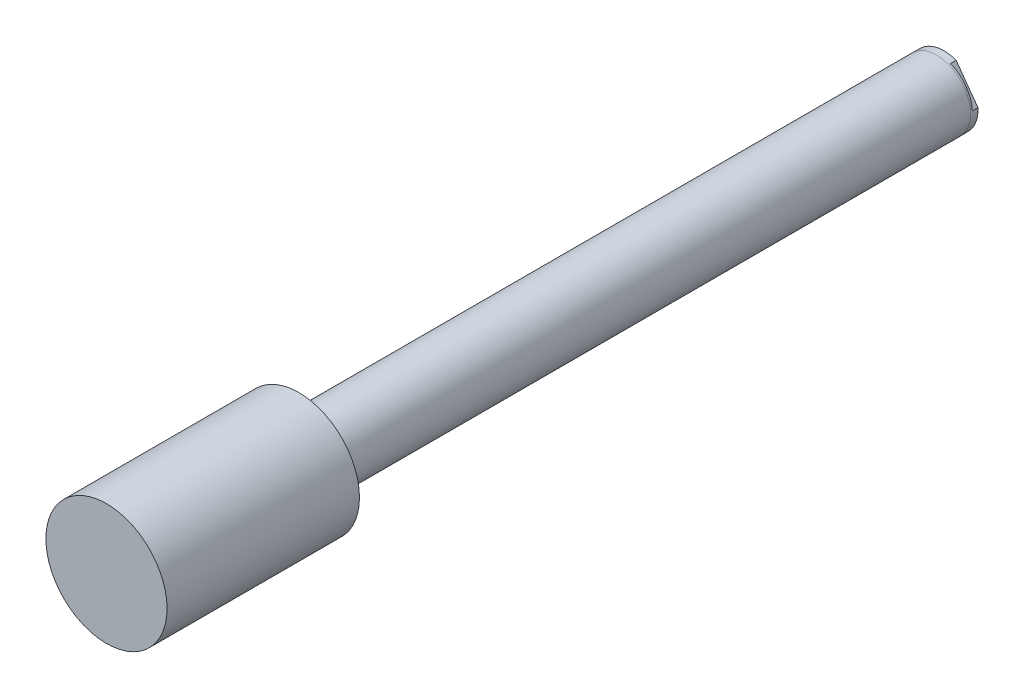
ISO-10303-21;
HEADER;
FILE_DESCRIPTION(('STEP AP214'),'2;1');
FILE_NAME('part.step','',(''),(''),'','','');
FILE_SCHEMA(('AUTOMOTIVE_DESIGN { 1 0 10303 214 1 1 1 1 }'));
ENDSEC;
DATA;
#1=APPLICATION_CONTEXT('core data for automotive mechanical design processes');
#2=APPLICATION_PROTOCOL_DEFINITION('international standard','automotive_design',2000,#1);
#3=PRODUCT_CONTEXT('',#1,'mechanical');
#4=PRODUCT('Part','Part','',(#3));
#5=PRODUCT_RELATED_PRODUCT_CATEGORY('part','',(#4));
#6=PRODUCT_DEFINITION_FORMATION('','',#4);
#7=PRODUCT_DEFINITION_CONTEXT('part definition',#1,'design');
#8=PRODUCT_DEFINITION('design','',#6,#7);
#9=PRODUCT_DEFINITION_SHAPE('','',#8);
#10=(LENGTH_UNIT() NAMED_UNIT(*) SI_UNIT(.MILLI.,.METRE.));
#11=(NAMED_UNIT(*) PLANE_ANGLE_UNIT() SI_UNIT($,.RADIAN.));
#12=(NAMED_UNIT(*) SI_UNIT($,.STERADIAN.) SOLID_ANGLE_UNIT());
#13=UNCERTAINTY_MEASURE_WITH_UNIT(LENGTH_MEASURE(1.E-05),#10,'distance_accuracy_value','');
#14=(GEOMETRIC_REPRESENTATION_CONTEXT(3) GLOBAL_UNCERTAINTY_ASSIGNED_CONTEXT((#13)) GLOBAL_UNIT_ASSIGNED_CONTEXT((#10,
#11,#12)) REPRESENTATION_CONTEXT('',''));
#15=CARTESIAN_POINT('',(0.,0.,0.));
#16=DIRECTION('',(0.,0.,1.));
#17=DIRECTION('',(1.,0.,0.));
#18=AXIS2_PLACEMENT_3D('',#15,#16,#17);
#19=CARTESIAN_POINT('',(0.,0.,-562.483));
#20=DIRECTION('',(0.,0.,-1.));
#21=DIRECTION('',(-1.,0.,0.));
#22=AXIS2_PLACEMENT_3D('',#19,#20,#21);
#23=PLANE('',#22);
#24=CARTESIAN_POINT('',(0.,0.,-562.483));
#25=DIRECTION('',(0.,0.,-1.));
#26=DIRECTION('',(0.,1.,0.));
#27=AXIS2_PLACEMENT_3D('',#24,#25,#26);
#28=CIRCLE('',#27,8.73125);
#29=CARTESIAN_POINT('',(0.,8.73125000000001,-562.483));
#30=VERTEX_POINT('',#29);
#31=EDGE_CURVE('E10',#30,#30,#28,.F.);
#32=ORIENTED_EDGE('',*,*,#31,.F.);
#33=EDGE_LOOP('',(#32));
#34=FACE_BOUND('',#33,.T.);
#35=ADVANCED_FACE('F16',(#34),#23,.T.);
#36=CARTESIAN_POINT('',(0.,0.,-595.8205));
#37=DIRECTION('',(0.,0.,-1.));
#38=DIRECTION('',(-0.587785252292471,0.809016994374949,0.));
#39=AXIS2_PLACEMENT_3D('',#36,#37,#38);
#40=PLANE('',#39);
#41=CARTESIAN_POINT('',(0.,0.,-595.8205));
#42=DIRECTION('',(0.,0.,-1.));
#43=DIRECTION('',(-0.587785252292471,0.809016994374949,0.));
#44=AXIS2_PLACEMENT_3D('',#41,#42,#43);
#45=CIRCLE('',#44,28.4607);
#46=CARTESIAN_POINT('',(-10.1024989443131,-26.6073478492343,-595.8205));
#47=VERTEX_POINT('',#46);
#48=CARTESIAN_POINT('',(-28.4269354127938,-1.38592479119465,-595.8205));
#49=VERTEX_POINT('',#48);
#50=EDGE_CURVE('E62',#47,#49,#45,.T.);
#51=ORIENTED_EDGE('',*,*,#50,.T.);
#52=DIRECTION('',(0.587785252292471,-0.809016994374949,0.));
#53=VECTOR('',#52,1.);
#54=CARTESIAN_POINT('',(-10.1024989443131,-26.6073478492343,-595.8205));
#55=LINE('',#54,#53);
#56=EDGE_CURVE('E64',#49,#47,#55,.T.);
#57=ORIENTED_EDGE('',*,*,#56,.T.);
#58=EDGE_LOOP('',(#51,#57));
#59=FACE_BOUND('',#58,.T.);
#60=ADVANCED_FACE('F63',(#59),#40,.T.);
#61=CARTESIAN_POINT('',(0.,0.,-595.8205));
#62=DIRECTION('',(0.,0.,-1.));
#63=DIRECTION('',(-0.587785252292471,0.809016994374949,0.));
#64=AXIS2_PLACEMENT_3D('',#61,#62,#63);
#65=PLANE('',#64);
#66=CARTESIAN_POINT('',(0.,0.,-595.8205));
#67=DIRECTION('',(0.,0.,-1.));
#68=DIRECTION('',(-0.587785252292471,0.809016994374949,0.));
#69=AXIS2_PLACEMENT_3D('',#66,#67,#68);
#70=CIRCLE('',#69,28.4607);
#71=CARTESIAN_POINT('',(10.1024989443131,26.6073478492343,-595.8205));
#72=VERTEX_POINT('',#71);
#73=CARTESIAN_POINT('',(28.4269354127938,1.38592479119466,-595.8205));
#74=VERTEX_POINT('',#73);
#75=EDGE_CURVE('E82',#72,#74,#70,.T.);
#76=ORIENTED_EDGE('',*,*,#75,.T.);
#77=DIRECTION('',(-0.587785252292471,0.809016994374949,0.));
#78=VECTOR('',#77,1.);
#79=CARTESIAN_POINT('',(28.4269354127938,1.38592479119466,-595.8205));
#80=LINE('',#79,#78);
#81=EDGE_CURVE('E84',#74,#72,#80,.T.);
#82=ORIENTED_EDGE('',*,*,#81,.T.);
#83=EDGE_LOOP('',(#76,#82));
#84=FACE_BOUND('',#83,.T.);
#85=ADVANCED_FACE('F137',(#84),#65,.T.);
#86=CARTESIAN_POINT('',(28.4269354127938,1.38592479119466,-595.8205));
#87=DIRECTION('',(-0.809016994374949,-0.587785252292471,0.));
#88=DIRECTION('',(0.,0.,-1.));
#89=AXIS2_PLACEMENT_3D('',#86,#87,#88);
#90=PLANE('',#89);
#91=DIRECTION('',(-0.587785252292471,0.809016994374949,0.));
#92=VECTOR('',#91,1.);
#93=CARTESIAN_POINT('',(28.4269354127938,1.38592479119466,-600.583));
#94=LINE('',#93,#92);
#95=CARTESIAN_POINT('',(28.4269354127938,1.38592479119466,-600.583));
#96=VERTEX_POINT('',#95);
#97=CARTESIAN_POINT('',(10.1024989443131,26.6073478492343,-600.583));
#98=VERTEX_POINT('',#97);
#99=EDGE_CURVE('E78',#96,#98,#94,.T.);
#100=ORIENTED_EDGE('',*,*,#99,.T.);
#101=DIRECTION('',(0.,0.,-1.));
#102=VECTOR('',#101,1.);
#103=CARTESIAN_POINT('',(10.1024989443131,26.6073478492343,-595.8205));
#104=LINE('',#103,#102);
#105=EDGE_CURVE('E88',#72,#98,#104,.T.);
#106=ORIENTED_EDGE('',*,*,#105,.F.);
#107=ORIENTED_EDGE('',*,*,#81,.F.);
#108=DIRECTION('',(0.,0.,-1.));
#109=VECTOR('',#108,1.);
#110=CARTESIAN_POINT('',(28.4269354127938,1.38592479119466,-595.8205));
#111=LINE('',#110,#109);
#112=EDGE_CURVE('E41',#74,#96,#111,.T.);
#113=ORIENTED_EDGE('',*,*,#112,.T.);
#114=EDGE_LOOP('',(#100,#106,#107,#113));
#115=FACE_BOUND('',#114,.T.);
#116=ADVANCED_FACE('F197',(#115),#90,.F.);
#117=CARTESIAN_POINT('',(0.,0.,-600.583));
#118=DIRECTION('',(0.,0.,-1.));
#119=DIRECTION('',(-0.587785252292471,0.809016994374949,0.));
#120=AXIS2_PLACEMENT_3D('',#117,#118,#119);
#121=PLANE('',#120);
#122=DIRECTION('',(0.587785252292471,-0.809016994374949,0.));
#123=VECTOR('',#122,1.);
#124=CARTESIAN_POINT('',(-10.1024989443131,-26.6073478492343,-600.583));
#125=LINE('',#124,#123);
#126=CARTESIAN_POINT('',(-28.4269354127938,-1.38592479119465,-600.583));
#127=VERTEX_POINT('',#126);
#128=CARTESIAN_POINT('',(-10.1024989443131,-26.6073478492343,-600.583));
#129=VERTEX_POINT('',#128);
#130=EDGE_CURVE('E67',#127,#129,#125,.T.);
#131=ORIENTED_EDGE('',*,*,#130,.F.);
#132=CARTESIAN_POINT('',(0.,0.,-600.583));
#133=DIRECTION('',(0.,0.,-1.));
#134=DIRECTION('',(-0.587785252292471,0.809016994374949,0.));
#135=AXIS2_PLACEMENT_3D('',#132,#133,#134);
#136=CIRCLE('',#135,28.4607);
#137=EDGE_CURVE('E76',#127,#98,#136,.T.);
#138=ORIENTED_EDGE('',*,*,#137,.T.);
#139=ORIENTED_EDGE('',*,*,#99,.F.);
#140=EDGE_CURVE('E94',#96,#129,#136,.T.);
#141=ORIENTED_EDGE('',*,*,#140,.T.);
#142=EDGE_LOOP('',(#131,#138,#139,#141));
#143=FACE_BOUND('',#142,.T.);
#144=CARTESIAN_POINT('',(0.,0.,-600.583));
#145=DIRECTION('',(0.,0.,-1.));
#146=DIRECTION('',(-0.587785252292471,0.809016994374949,0.));
#147=AXIS2_PLACEMENT_3D('',#144,#145,#146);
#148=CIRCLE('',#147,8.73125);
#149=CARTESIAN_POINT('',(-5.13209998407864,7.06372963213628,-600.583));
#150=VERTEX_POINT('',#149);
#151=EDGE_CURVE('E90',#150,#150,#148,.T.);
#152=ORIENTED_EDGE('',*,*,#151,.F.);
#153=EDGE_LOOP('',(#152));
#154=FACE_BOUND('',#153,.T.);
#155=ADVANCED_FACE('F205',(#143,#154),#121,.T.);
#156=CARTESIAN_POINT('',(0.,0.,-600.583));
#157=DIRECTION('',(0.,0.,-1.));
#158=DIRECTION('',(-0.587785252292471,0.809016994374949,0.));
#159=AXIS2_PLACEMENT_3D('',#156,#157,#158);
#160=CYLINDRICAL_SURFACE('',#159,8.73125);
#161=ORIENTED_EDGE('',*,*,#151,.T.);
#162=EDGE_LOOP('',(#161));
#163=FACE_BOUND('',#162,.T.);
#164=ORIENTED_EDGE('',*,*,#31,.T.);
#165=EDGE_LOOP('',(#164));
#166=FACE_BOUND('',#165,.T.);
#167=ADVANCED_FACE('F213',(#163,#166),#160,.F.);
#168=CARTESIAN_POINT('',(-10.1024989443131,-26.6073478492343,-595.8205));
#169=DIRECTION('',(0.809016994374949,0.587785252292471,0.));
#170=DIRECTION('',(0.,0.,1.));
#171=AXIS2_PLACEMENT_3D('',#168,#169,#170);
#172=PLANE('',#171);
#173=ORIENTED_EDGE('',*,*,#130,.T.);
#174=DIRECTION('',(0.,0.,-1.));
#175=VECTOR('',#174,1.);
#176=CARTESIAN_POINT('',(-10.1024989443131,-26.6073478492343,-595.8205));
#177=LINE('',#176,#175);
#178=EDGE_CURVE('E70',#47,#129,#177,.T.);
#179=ORIENTED_EDGE('',*,*,#178,.F.);
#180=ORIENTED_EDGE('',*,*,#56,.F.);
#181=DIRECTION('',(0.,0.,-1.));
#182=VECTOR('',#181,1.);
#183=CARTESIAN_POINT('',(-28.4269354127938,-1.38592479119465,-595.8205));
#184=LINE('',#183,#182);
#185=EDGE_CURVE('E33',#49,#127,#184,.T.);
#186=ORIENTED_EDGE('',*,*,#185,.T.);
#187=EDGE_LOOP('',(#173,#179,#180,#186));
#188=FACE_BOUND('',#187,.T.);
#189=ADVANCED_FACE('F69',(#188),#172,.F.);
#190=CARTESIAN_POINT('',(0.,0.,-604.843051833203));
#191=DIRECTION('',(0.,0.,-1.));
#192=DIRECTION('',(-0.587785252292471,0.809016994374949,0.));
#193=AXIS2_PLACEMENT_3D('',#190,#191,#192);
#194=CYLINDRICAL_SURFACE('',#193,28.4607);
#195=ORIENTED_EDGE('',*,*,#178,.T.);
#196=ORIENTED_EDGE('',*,*,#140,.F.);
#197=ORIENTED_EDGE('',*,*,#112,.F.);
#198=ORIENTED_EDGE('',*,*,#75,.F.);
#199=ORIENTED_EDGE('',*,*,#105,.T.);
#200=ORIENTED_EDGE('',*,*,#137,.F.);
#201=ORIENTED_EDGE('',*,*,#185,.F.);
#202=ORIENTED_EDGE('',*,*,#50,.F.);
#203=EDGE_LOOP('',(#195,#196,#197,#198,#199,#200,#201,#202));
#204=FACE_BOUND('',#203,.T.);
#205=CARTESIAN_POINT('',(0.,0.,-594.233));
#206=DIRECTION('',(0.,0.,-1.));
#207=DIRECTION('',(-0.587785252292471,0.809016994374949,0.));
#208=AXIS2_PLACEMENT_3D('',#205,#206,#207);
#209=CIRCLE('',#208,28.4607);
#210=CARTESIAN_POINT('',(-16.7287797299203,23.0251899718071,-594.233));
#211=VERTEX_POINT('',#210);
#212=EDGE_CURVE('E25',#211,#211,#209,.T.);
#213=ORIENTED_EDGE('',*,*,#212,.T.);
#214=EDGE_LOOP('',(#213));
#215=FACE_BOUND('',#214,.T.);
#216=ADVANCED_FACE('F73',(#204,#215),#194,.T.);
#217=CARTESIAN_POINT('',(0.,0.,101.6));
#218=DIRECTION('',(0.,0.,1.));
#219=DIRECTION('',(1.,0.,0.));
#220=AXIS2_PLACEMENT_3D('',#217,#218,#219);
#221=PLANE('',#220);
#222=CARTESIAN_POINT('',(0.,0.,101.6));
#223=DIRECTION('',(0.,0.,1.));
#224=DIRECTION('',(1.,0.,0.));
#225=AXIS2_PLACEMENT_3D('',#222,#223,#224);
#226=CIRCLE('',#225,50.8);
#227=CARTESIAN_POINT('',(50.8,0.,101.6));
#228=VERTEX_POINT('',#227);
#229=EDGE_CURVE('E99',#228,#228,#226,.T.);
#230=ORIENTED_EDGE('',*,*,#229,.T.);
#231=EDGE_LOOP('',(#230));
#232=FACE_BOUND('',#231,.T.);
#233=ADVANCED_FACE('F116',(#232),#221,.T.);
#234=CARTESIAN_POINT('',(0.,0.,-59.69));
#235=DIRECTION('',(0.,0.,1.));
#236=DIRECTION('',(1.,0.,0.));
#237=AXIS2_PLACEMENT_3D('',#234,#235,#236);
#238=CYLINDRICAL_SURFACE('',#237,50.8);
#239=CARTESIAN_POINT('',(0.,0.,-59.69));
#240=DIRECTION('',(0.,0.,1.));
#241=DIRECTION('',(1.,0.,0.));
#242=AXIS2_PLACEMENT_3D('',#239,#240,#241);
#243=CIRCLE('',#242,50.8);
#244=CARTESIAN_POINT('',(50.8,0.,-59.69));
#245=VERTEX_POINT('',#244);
#246=EDGE_CURVE('E102',#245,#245,#243,.T.);
#247=ORIENTED_EDGE('',*,*,#246,.T.);
#248=EDGE_LOOP('',(#247));
#249=FACE_BOUND('',#248,.T.);
#250=ORIENTED_EDGE('',*,*,#229,.F.);
#251=EDGE_LOOP('',(#250));
#252=FACE_BOUND('',#251,.T.);
#253=ADVANCED_FACE('F124',(#249,#252),#238,.T.);
#254=CARTESIAN_POINT('',(0.,0.,-59.69));
#255=DIRECTION('',(0.,0.,1.));
#256=DIRECTION('',(1.,0.,0.));
#257=AXIS2_PLACEMENT_3D('',#254,#255,#256);
#258=PLANE('',#257);
#259=ORIENTED_EDGE('',*,*,#246,.F.);
#260=EDGE_LOOP('',(#259));
#261=FACE_BOUND('',#260,.T.);
#262=CARTESIAN_POINT('',(0.,0.,-59.69));
#263=DIRECTION('',(0.,0.,1.));
#264=DIRECTION('',(1.,0.,0.));
#265=AXIS2_PLACEMENT_3D('',#262,#263,#264);
#266=CIRCLE('',#265,28.575);
#267=CARTESIAN_POINT('',(28.575,0.,-59.69));
#268=VERTEX_POINT('',#267);
#269=EDGE_CURVE('E104',#268,#268,#266,.T.);
#270=ORIENTED_EDGE('',*,*,#269,.T.);
#271=EDGE_LOOP('',(#270));
#272=FACE_BOUND('',#271,.T.);
#273=ADVANCED_FACE('F115',(#261,#272),#258,.F.);
#274=CARTESIAN_POINT('',(0.,0.,-594.233));
#275=DIRECTION('',(0.,0.,1.));
#276=DIRECTION('',(1.,0.,0.));
#277=AXIS2_PLACEMENT_3D('',#274,#275,#276);
#278=CYLINDRICAL_SURFACE('',#277,28.575);
#279=CARTESIAN_POINT('',(0.,0.,-594.233));
#280=DIRECTION('',(0.,0.,-1.));
#281=DIRECTION('',(-1.,0.,0.));
#282=AXIS2_PLACEMENT_3D('',#279,#280,#281);
#283=CIRCLE('',#282,28.575);
#284=CARTESIAN_POINT('',(-28.575,0.,-594.233));
#285=VERTEX_POINT('',#284);
#286=EDGE_CURVE('E20',#285,#285,#283,.T.);
#287=ORIENTED_EDGE('',*,*,#286,.F.);
#288=EDGE_LOOP('',(#287));
#289=FACE_BOUND('',#288,.T.);
#290=ORIENTED_EDGE('',*,*,#269,.F.);
#291=EDGE_LOOP('',(#290));
#292=FACE_BOUND('',#291,.T.);
#293=ADVANCED_FACE('F18',(#289,#292),#278,.T.);
#294=CARTESIAN_POINT('',(0.,0.,-594.233));
#295=DIRECTION('',(0.,0.,-1.));
#296=DIRECTION('',(-1.,0.,0.));
#297=AXIS2_PLACEMENT_3D('',#294,#295,#296);
#298=PLANE('',#297);
#299=ORIENTED_EDGE('',*,*,#212,.F.);
#300=EDGE_LOOP('',(#299));
#301=FACE_BOUND('',#300,.T.);
#302=ORIENTED_EDGE('',*,*,#286,.T.);
#303=EDGE_LOOP('',(#302));
#304=FACE_BOUND('',#303,.T.);
#305=ADVANCED_FACE('F111',(#301,#304),#298,.T.);
#306=CLOSED_SHELL('',(#35,#60,#85,#116,#155,#167,#189,#216,#233,#253,#273,#293,#305));
#307=MANIFOLD_SOLID_BREP('B1',#306);
#308=ADVANCED_BREP_SHAPE_REPRESENTATION('',(#18,#307),#14);
#309=SHAPE_DEFINITION_REPRESENTATION(#9,#308);
ENDSEC;
END-ISO-10303-21;
